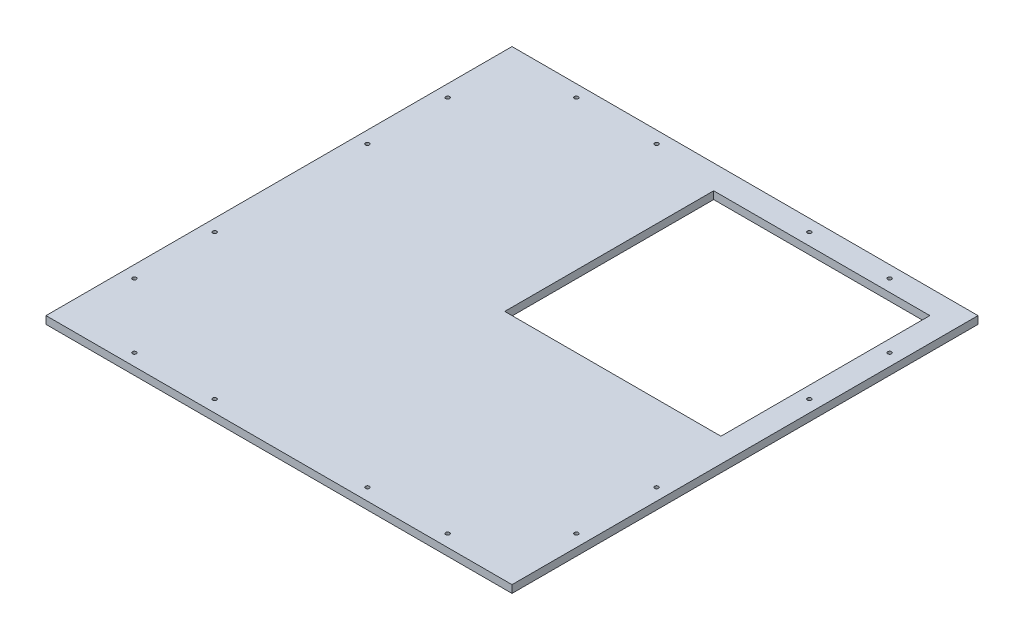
from build123d import *

# Parameters (mm, degrees)
SKETCH1_W           = 1220
SKETCH1_H           = 1220
BOSS_EXTRUDE1_DEPTH = 20
SKETCH2_W           = 566
SKETCH2_H           = 547
CUT_EXTRUDE1_DEPTH  = 20
CUT_EXTRUDE2_REACH  = 1727.456
SKETCH3_R           = 5


with BuildPart() as part:
    # Sketch1 → Boss-Extrude1 (new body)
    with BuildSketch(Plane(origin=(0, 0, 0), x_dir=(1, 0, 0), z_dir=(0, 1, 0))):
        with Locations((610, 610)):
            Rectangle(SKETCH1_W, SKETCH1_H)
    extrude(amount=BOSS_EXTRUDE1_DEPTH)

    # Sketch2 → Cut-Extrude1 (cut)
    with BuildSketch(Plane(origin=(0, 20, 0), x_dir=(1, 0, 0), z_dir=(0, 1, 0))):
        with Locations((874, 883.5)):
            Rectangle(SKETCH2_W, SKETCH2_H)
    extrude(amount=-CUT_EXTRUDE1_DEPTH, mode=Mode.SUBTRACT)

    # Sketch3 → Cut-Extrude2 (cut, up to next)
    with BuildSketch(Plane(origin=(0, 20, 0), x_dir=(1, 0, 0), z_dir=(0, 1, 0)), mode=Mode.PRIVATE) as cut_extrude2_sk1:
        with Locations(Location((410, 1188.5, 0), (0, 0, 270))):
            Circle(SKETCH3_R)
    cut_extrude2_tool1 = extrude(cut_extrude2_sk1.sketch, amount=-CUT_EXTRUDE2_REACH, mode=Mode.PRIVATE) & part.part
    # Sketch3 → Cut-Extrude2 (cut, up to next)
    with BuildSketch(Plane(origin=(0, 20, 0), x_dir=(1, 0, 0), z_dir=(0, 1, 0)), mode=Mode.PRIVATE) as cut_extrude2_sk2:
        with Locations(Location((200, 1188.5, 0), (0, 0, 270))):
            Circle(SKETCH3_R)
    cut_extrude2_tool2 = extrude(cut_extrude2_sk2.sketch, amount=-CUT_EXTRUDE2_REACH, mode=Mode.PRIVATE) & part.part
    # Sketch3 → Cut-Extrude2 (cut, up to next)
    with BuildSketch(Plane(origin=(0, 20, 0), x_dir=(1, 0, 0), z_dir=(0, 1, 0)), mode=Mode.PRIVATE) as cut_extrude2_sk3:
        with Locations(Location((31.5, 1020, 0), (0, 0, 270))):
            Circle(SKETCH3_R)
    cut_extrude2_tool3 = extrude(cut_extrude2_sk3.sketch, amount=-CUT_EXTRUDE2_REACH, mode=Mode.PRIVATE) & part.part
    # Sketch3 → Cut-Extrude2 (cut, up to next)
    with BuildSketch(Plane(origin=(0, 20, 0), x_dir=(1, 0, 0), z_dir=(0, 1, 0)), mode=Mode.PRIVATE) as cut_extrude2_sk4:
        with Locations(Location((31.5, 810, 0), (0, 0, 270))):
            Circle(SKETCH3_R)
    cut_extrude2_tool4 = extrude(cut_extrude2_sk4.sketch, amount=-CUT_EXTRUDE2_REACH, mode=Mode.PRIVATE) & part.part
    # Sketch3 → Cut-Extrude2 (cut, up to next)
    with BuildSketch(Plane(origin=(0, 20, 0), x_dir=(1, 0, 0), z_dir=(0, 1, 0)), mode=Mode.PRIVATE) as cut_extrude2_sk5:
        with Locations(Location((31.5, 410, 0), (0, 0, 270))):
            Circle(SKETCH3_R)
    cut_extrude2_tool5 = extrude(cut_extrude2_sk5.sketch, amount=-CUT_EXTRUDE2_REACH, mode=Mode.PRIVATE) & part.part
    # Sketch3 → Cut-Extrude2 (cut, up to next)
    with BuildSketch(Plane(origin=(0, 20, 0), x_dir=(1, 0, 0), z_dir=(0, 1, 0)), mode=Mode.PRIVATE) as cut_extrude2_sk6:
        with Locations(Location((31.5, 200, 0), (0, 0, 270))):
            Circle(SKETCH3_R)
    cut_extrude2_tool6 = extrude(cut_extrude2_sk6.sketch, amount=-CUT_EXTRUDE2_REACH, mode=Mode.PRIVATE) & part.part
    # Sketch3 → Cut-Extrude2 (cut, up to next)
    with BuildSketch(Plane(origin=(0, 20, 0), x_dir=(1, 0, 0), z_dir=(0, 1, 0)), mode=Mode.PRIVATE) as cut_extrude2_sk7:
        with Locations(Location((200, 31.5, 0), (0, 0, 270))):
            Circle(SKETCH3_R)
    cut_extrude2_tool7 = extrude(cut_extrude2_sk7.sketch, amount=-CUT_EXTRUDE2_REACH, mode=Mode.PRIVATE) & part.part
    # Sketch3 → Cut-Extrude2 (cut, up to next)
    with BuildSketch(Plane(origin=(0, 20, 0), x_dir=(1, 0, 0), z_dir=(0, 1, 0)), mode=Mode.PRIVATE) as cut_extrude2_sk8:
        with Locations(Location((410, 31.5, 0), (0, 0, 270))):
            Circle(SKETCH3_R)
    cut_extrude2_tool8 = extrude(cut_extrude2_sk8.sketch, amount=-CUT_EXTRUDE2_REACH, mode=Mode.PRIVATE) & part.part
    # Sketch3 → Cut-Extrude2 (cut, up to next)
    with BuildSketch(Plane(origin=(0, 20, 0), x_dir=(1, 0, 0), z_dir=(0, 1, 0)), mode=Mode.PRIVATE) as cut_extrude2_sk9:
        with Locations(Location((810, 31.5, 0), (0, 0, 270))):
            Circle(SKETCH3_R)
    cut_extrude2_tool9 = extrude(cut_extrude2_sk9.sketch, amount=-CUT_EXTRUDE2_REACH, mode=Mode.PRIVATE) & part.part
    # Sketch3 → Cut-Extrude2 (cut, up to next)
    with BuildSketch(Plane(origin=(0, 20, 0), x_dir=(1, 0, 0), z_dir=(0, 1, 0)), mode=Mode.PRIVATE) as cut_extrude2_sk10:
        with Locations(Location((1020, 31.5, 0), (0, 0, 270))):
            Circle(SKETCH3_R)
    cut_extrude2_tool10 = extrude(cut_extrude2_sk10.sketch, amount=-CUT_EXTRUDE2_REACH, mode=Mode.PRIVATE) & part.part
    # Sketch3 → Cut-Extrude2 (cut, up to next)
    with BuildSketch(Plane(origin=(0, 20, 0), x_dir=(1, 0, 0), z_dir=(0, 1, 0)), mode=Mode.PRIVATE) as cut_extrude2_sk11:
        with Locations(Location((1188.5, 410, 0), (0, 0, 270))):
            Circle(SKETCH3_R)
    cut_extrude2_tool11 = extrude(cut_extrude2_sk11.sketch, amount=-CUT_EXTRUDE2_REACH, mode=Mode.PRIVATE) & part.part
    # Sketch3 → Cut-Extrude2 (cut, up to next)
    with BuildSketch(Plane(origin=(0, 20, 0), x_dir=(1, 0, 0), z_dir=(0, 1, 0)), mode=Mode.PRIVATE) as cut_extrude2_sk12:
        with Locations(Location((1188.5, 200, 0), (0, 0, 270))):
            Circle(SKETCH3_R)
    cut_extrude2_tool12 = extrude(cut_extrude2_sk12.sketch, amount=-CUT_EXTRUDE2_REACH, mode=Mode.PRIVATE) & part.part
    # Sketch3 → Cut-Extrude2 (cut, up to next)
    with BuildSketch(Plane(origin=(0, 20, 0), x_dir=(1, 0, 0), z_dir=(0, 1, 0)), mode=Mode.PRIVATE) as cut_extrude2_sk13:
        with Locations(Location((1188.5, 810, 0), (0, 0, 270))):
            Circle(SKETCH3_R)
    cut_extrude2_tool13 = extrude(cut_extrude2_sk13.sketch, amount=-CUT_EXTRUDE2_REACH, mode=Mode.PRIVATE) & part.part
    # Sketch3 → Cut-Extrude2 (cut, up to next)
    with BuildSketch(Plane(origin=(0, 20, 0), x_dir=(1, 0, 0), z_dir=(0, 1, 0)), mode=Mode.PRIVATE) as cut_extrude2_sk14:
        with Locations(Location((1188.5, 1020, 0), (0, 0, 270))):
            Circle(SKETCH3_R)
    cut_extrude2_tool14 = extrude(cut_extrude2_sk14.sketch, amount=-CUT_EXTRUDE2_REACH, mode=Mode.PRIVATE) & part.part
    # Sketch3 → Cut-Extrude2 (cut, up to next)
    with BuildSketch(Plane(origin=(0, 20, 0), x_dir=(1, 0, 0), z_dir=(0, 1, 0)), mode=Mode.PRIVATE) as cut_extrude2_sk15:
        with Locations(Location((1020, 1188.5, 0), (0, 0, 270))):
            Circle(SKETCH3_R)
    cut_extrude2_tool15 = extrude(cut_extrude2_sk15.sketch, amount=-CUT_EXTRUDE2_REACH, mode=Mode.PRIVATE) & part.part
    # Sketch3 → Cut-Extrude2 (cut, up to next)
    with BuildSketch(Plane(origin=(0, 20, 0), x_dir=(1, 0, 0), z_dir=(0, 1, 0)), mode=Mode.PRIVATE) as cut_extrude2_sk16:
        with Locations(Location((810, 1188.5, 0), (0, 0, 270))):
            Circle(SKETCH3_R)
    cut_extrude2_tool16 = extrude(cut_extrude2_sk16.sketch, amount=-CUT_EXTRUDE2_REACH, mode=Mode.PRIVATE) & part.part
    add(cut_extrude2_tool1.solids().sort_by_distance((410, 20, -1188.5))[0], mode=Mode.SUBTRACT)
    add(cut_extrude2_tool2.solids().sort_by_distance((200, 20, -1188.5))[0], mode=Mode.SUBTRACT)
    add(cut_extrude2_tool3.solids().sort_by_distance((31.5, 20, -1020))[0], mode=Mode.SUBTRACT)
    add(cut_extrude2_tool4.solids().sort_by_distance((31.5, 20, -810))[0], mode=Mode.SUBTRACT)
    add(cut_extrude2_tool5.solids().sort_by_distance((31.5, 20, -410))[0], mode=Mode.SUBTRACT)
    add(cut_extrude2_tool6.solids().sort_by_distance((31.5, 20, -200))[0], mode=Mode.SUBTRACT)
    add(cut_extrude2_tool7.solids().sort_by_distance((200, 20, -31.5))[0], mode=Mode.SUBTRACT)
    add(cut_extrude2_tool8.solids().sort_by_distance((410, 20, -31.5))[0], mode=Mode.SUBTRACT)
    add(cut_extrude2_tool9.solids().sort_by_distance((810, 20, -31.5))[0], mode=Mode.SUBTRACT)
    add(cut_extrude2_tool10.solids().sort_by_distance((1020, 20, -31.5))[0], mode=Mode.SUBTRACT)
    add(cut_extrude2_tool11.solids().sort_by_distance((1188.5, 20, -410))[0], mode=Mode.SUBTRACT)
    add(cut_extrude2_tool12.solids().sort_by_distance((1188.5, 20, -200))[0], mode=Mode.SUBTRACT)
    add(cut_extrude2_tool13.solids().sort_by_distance((1188.5, 20, -810))[0], mode=Mode.SUBTRACT)
    add(cut_extrude2_tool14.solids().sort_by_distance((1188.5, 20, -1020))[0], mode=Mode.SUBTRACT)
    add(cut_extrude2_tool15.solids().sort_by_distance((1020, 20, -1188.5))[0], mode=Mode.SUBTRACT)
    add(cut_extrude2_tool16.solids().sort_by_distance((810, 20, -1188.5))[0], mode=Mode.SUBTRACT)


solid = part.part
